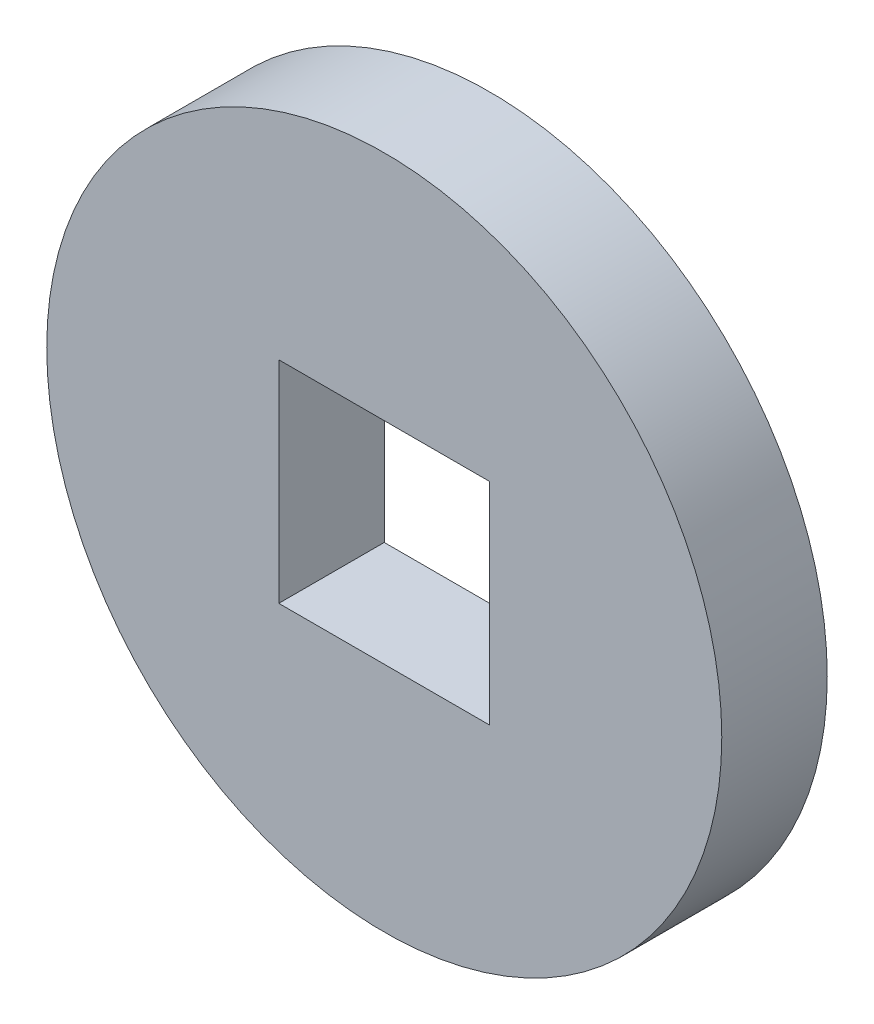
ISO-10303-21;
HEADER;
FILE_DESCRIPTION(('STEP AP214'),'2;1');
FILE_NAME('part.step','',(''),(''),'','','');
FILE_SCHEMA(('AUTOMOTIVE_DESIGN { 1 0 10303 214 1 1 1 1 }'));
ENDSEC;
DATA;
#1=APPLICATION_CONTEXT('core data for automotive mechanical design processes');
#2=APPLICATION_PROTOCOL_DEFINITION('international standard','automotive_design',2000,#1);
#3=PRODUCT_CONTEXT('',#1,'mechanical');
#4=PRODUCT('Part','Part','',(#3));
#5=PRODUCT_RELATED_PRODUCT_CATEGORY('part','',(#4));
#6=PRODUCT_DEFINITION_FORMATION('','',#4);
#7=PRODUCT_DEFINITION_CONTEXT('part definition',#1,'design');
#8=PRODUCT_DEFINITION('design','',#6,#7);
#9=PRODUCT_DEFINITION_SHAPE('','',#8);
#10=(LENGTH_UNIT() NAMED_UNIT(*) SI_UNIT(.MILLI.,.METRE.));
#11=(NAMED_UNIT(*) PLANE_ANGLE_UNIT() SI_UNIT($,.RADIAN.));
#12=(NAMED_UNIT(*) SI_UNIT($,.STERADIAN.) SOLID_ANGLE_UNIT());
#13=UNCERTAINTY_MEASURE_WITH_UNIT(LENGTH_MEASURE(1.E-05),#10,'distance_accuracy_value','');
#14=(GEOMETRIC_REPRESENTATION_CONTEXT(3) GLOBAL_UNCERTAINTY_ASSIGNED_CONTEXT((#13)) GLOBAL_UNIT_ASSIGNED_CONTEXT((#10,
#11,#12)) REPRESENTATION_CONTEXT('',''));
#15=CARTESIAN_POINT('',(0.,0.,0.));
#16=DIRECTION('',(0.,0.,1.));
#17=DIRECTION('',(1.,0.,0.));
#18=AXIS2_PLACEMENT_3D('',#15,#16,#17);
#19=CARTESIAN_POINT('',(0.,0.,3.175));
#20=DIRECTION('',(0.,0.,1.));
#21=DIRECTION('',(1.,0.,0.));
#22=AXIS2_PLACEMENT_3D('',#19,#20,#21);
#23=PLANE('',#22);
#24=CARTESIAN_POINT('',(0.,0.,3.175));
#25=DIRECTION('',(0.,0.,1.));
#26=DIRECTION('',(1.,0.,0.));
#27=AXIS2_PLACEMENT_3D('',#24,#25,#26);
#28=CIRCLE('',#27,10.16);
#29=CARTESIAN_POINT('',(10.16,0.,3.175));
#30=VERTEX_POINT('',#29);
#31=EDGE_CURVE('E11',#30,#30,#28,.T.);
#32=ORIENTED_EDGE('',*,*,#31,.T.);
#33=EDGE_LOOP('',(#32));
#34=FACE_BOUND('',#33,.T.);
#35=DIRECTION('',(-1.,0.,0.));
#36=VECTOR('',#35,1.);
#37=CARTESIAN_POINT('',(-3.175,3.175,3.175));
#38=LINE('',#37,#36);
#39=CARTESIAN_POINT('',(3.175,3.175,3.175));
#40=VERTEX_POINT('',#39);
#41=CARTESIAN_POINT('',(-3.175,3.175,3.175));
#42=VERTEX_POINT('',#41);
#43=EDGE_CURVE('E82',#40,#42,#38,.T.);
#44=ORIENTED_EDGE('',*,*,#43,.F.);
#45=DIRECTION('',(0.,1.,0.));
#46=VECTOR('',#45,1.);
#47=CARTESIAN_POINT('',(3.175,3.175,3.175));
#48=LINE('',#47,#46);
#49=CARTESIAN_POINT('',(3.175,-3.175,3.175));
#50=VERTEX_POINT('',#49);
#51=EDGE_CURVE('E74',#50,#40,#48,.T.);
#52=ORIENTED_EDGE('',*,*,#51,.F.);
#53=DIRECTION('',(1.,0.,0.));
#54=VECTOR('',#53,1.);
#55=CARTESIAN_POINT('',(-3.175,-3.175,3.175));
#56=LINE('',#55,#54);
#57=CARTESIAN_POINT('',(-3.175,-3.175,3.175));
#58=VERTEX_POINT('',#57);
#59=EDGE_CURVE('E95',#58,#50,#56,.T.);
#60=ORIENTED_EDGE('',*,*,#59,.F.);
#61=DIRECTION('',(0.,-1.,0.));
#62=VECTOR('',#61,1.);
#63=CARTESIAN_POINT('',(-3.175,3.175,3.175));
#64=LINE('',#63,#62);
#65=EDGE_CURVE('E93',#42,#58,#64,.T.);
#66=ORIENTED_EDGE('',*,*,#65,.F.);
#67=EDGE_LOOP('',(#44,#52,#60,#66));
#68=FACE_BOUND('',#67,.T.);
#69=ADVANCED_FACE('F33',(#34,#68),#23,.T.);
#70=CARTESIAN_POINT('',(0.,0.,0.));
#71=DIRECTION('',(0.,0.,1.));
#72=DIRECTION('',(1.,0.,0.));
#73=AXIS2_PLACEMENT_3D('',#70,#71,#72);
#74=PLANE('',#73);
#75=CARTESIAN_POINT('',(0.,0.,0.));
#76=DIRECTION('',(0.,0.,1.));
#77=DIRECTION('',(1.,0.,0.));
#78=AXIS2_PLACEMENT_3D('',#75,#76,#77);
#79=CIRCLE('',#78,10.16);
#80=CARTESIAN_POINT('',(10.16,0.,0.));
#81=VERTEX_POINT('',#80);
#82=EDGE_CURVE('E37',#81,#81,#79,.T.);
#83=ORIENTED_EDGE('',*,*,#82,.F.);
#84=EDGE_LOOP('',(#83));
#85=FACE_BOUND('',#84,.T.);
#86=DIRECTION('',(0.,1.,0.));
#87=VECTOR('',#86,1.);
#88=CARTESIAN_POINT('',(3.175,3.175,0.));
#89=LINE('',#88,#87);
#90=CARTESIAN_POINT('',(3.175,-3.175,0.));
#91=VERTEX_POINT('',#90);
#92=CARTESIAN_POINT('',(3.175,3.175,0.));
#93=VERTEX_POINT('',#92);
#94=EDGE_CURVE('E56',#91,#93,#89,.T.);
#95=ORIENTED_EDGE('',*,*,#94,.T.);
#96=DIRECTION('',(-1.,0.,0.));
#97=VECTOR('',#96,1.);
#98=CARTESIAN_POINT('',(-3.175,3.175,0.));
#99=LINE('',#98,#97);
#100=CARTESIAN_POINT('',(-3.175,3.175,0.));
#101=VERTEX_POINT('',#100);
#102=EDGE_CURVE('E89',#93,#101,#99,.T.);
#103=ORIENTED_EDGE('',*,*,#102,.T.);
#104=DIRECTION('',(0.,-1.,0.));
#105=VECTOR('',#104,1.);
#106=CARTESIAN_POINT('',(-3.175,3.175,0.));
#107=LINE('',#106,#105);
#108=CARTESIAN_POINT('',(-3.175,-3.175,0.));
#109=VERTEX_POINT('',#108);
#110=EDGE_CURVE('E101',#101,#109,#107,.T.);
#111=ORIENTED_EDGE('',*,*,#110,.T.);
#112=DIRECTION('',(1.,0.,0.));
#113=VECTOR('',#112,1.);
#114=CARTESIAN_POINT('',(-3.175,-3.175,0.));
#115=LINE('',#114,#113);
#116=EDGE_CURVE('E83',#109,#91,#115,.T.);
#117=ORIENTED_EDGE('',*,*,#116,.T.);
#118=EDGE_LOOP('',(#95,#103,#111,#117));
#119=FACE_BOUND('',#118,.T.);
#120=ADVANCED_FACE('F112',(#85,#119),#74,.F.);
#121=CARTESIAN_POINT('',(0.,0.,3.175));
#122=DIRECTION('',(0.,0.,-1.));
#123=DIRECTION('',(-1.,0.,0.));
#124=AXIS2_PLACEMENT_3D('',#121,#122,#123);
#125=CYLINDRICAL_SURFACE('',#124,10.16);
#126=ORIENTED_EDGE('',*,*,#31,.F.);
#127=EDGE_LOOP('',(#126));
#128=FACE_BOUND('',#127,.T.);
#129=ORIENTED_EDGE('',*,*,#82,.T.);
#130=EDGE_LOOP('',(#129));
#131=FACE_BOUND('',#130,.T.);
#132=ADVANCED_FACE('F35',(#128,#131),#125,.T.);
#133=CARTESIAN_POINT('',(3.175,3.175,3.175));
#134=DIRECTION('',(-1.,0.,0.));
#135=DIRECTION('',(0.,-1.,0.));
#136=AXIS2_PLACEMENT_3D('',#133,#134,#135);
#137=PLANE('',#136);
#138=ORIENTED_EDGE('',*,*,#94,.F.);
#139=DIRECTION('',(0.,0.,-1.));
#140=VECTOR('',#139,1.);
#141=CARTESIAN_POINT('',(3.175,-3.175,3.175));
#142=LINE('',#141,#140);
#143=EDGE_CURVE('E78',#50,#91,#142,.T.);
#144=ORIENTED_EDGE('',*,*,#143,.F.);
#145=ORIENTED_EDGE('',*,*,#51,.T.);
#146=DIRECTION('',(0.,0.,-1.));
#147=VECTOR('',#146,1.);
#148=CARTESIAN_POINT('',(3.175,3.175,3.175));
#149=LINE('',#148,#147);
#150=EDGE_CURVE('E77',#40,#93,#149,.T.);
#151=ORIENTED_EDGE('',*,*,#150,.T.);
#152=EDGE_LOOP('',(#138,#144,#145,#151));
#153=FACE_BOUND('',#152,.T.);
#154=ADVANCED_FACE('F76',(#153),#137,.T.);
#155=CARTESIAN_POINT('',(-3.175,3.175,3.175));
#156=DIRECTION('',(0.,-1.,0.));
#157=DIRECTION('',(0.,0.,-1.));
#158=AXIS2_PLACEMENT_3D('',#155,#156,#157);
#159=PLANE('',#158);
#160=ORIENTED_EDGE('',*,*,#102,.F.);
#161=ORIENTED_EDGE('',*,*,#150,.F.);
#162=ORIENTED_EDGE('',*,*,#43,.T.);
#163=DIRECTION('',(0.,0.,-1.));
#164=VECTOR('',#163,1.);
#165=CARTESIAN_POINT('',(-3.175,3.175,3.175));
#166=LINE('',#165,#164);
#167=EDGE_CURVE('E90',#42,#101,#166,.T.);
#168=ORIENTED_EDGE('',*,*,#167,.T.);
#169=EDGE_LOOP('',(#160,#161,#162,#168));
#170=FACE_BOUND('',#169,.T.);
#171=ADVANCED_FACE('F86',(#170),#159,.T.);
#172=CARTESIAN_POINT('',(-3.175,3.175,3.175));
#173=DIRECTION('',(1.,0.,0.));
#174=DIRECTION('',(0.,1.,0.));
#175=AXIS2_PLACEMENT_3D('',#172,#173,#174);
#176=PLANE('',#175);
#177=ORIENTED_EDGE('',*,*,#110,.F.);
#178=ORIENTED_EDGE('',*,*,#167,.F.);
#179=ORIENTED_EDGE('',*,*,#65,.T.);
#180=DIRECTION('',(0.,0.,-1.));
#181=VECTOR('',#180,1.);
#182=CARTESIAN_POINT('',(-3.175,-3.175,3.175));
#183=LINE('',#182,#181);
#184=EDGE_CURVE('E48',#58,#109,#183,.T.);
#185=ORIENTED_EDGE('',*,*,#184,.T.);
#186=EDGE_LOOP('',(#177,#178,#179,#185));
#187=FACE_BOUND('',#186,.T.);
#188=ADVANCED_FACE('F110',(#187),#176,.T.);
#189=CARTESIAN_POINT('',(-3.175,-3.175,3.175));
#190=DIRECTION('',(0.,1.,0.));
#191=DIRECTION('',(0.,0.,1.));
#192=AXIS2_PLACEMENT_3D('',#189,#190,#191);
#193=PLANE('',#192);
#194=ORIENTED_EDGE('',*,*,#116,.F.);
#195=ORIENTED_EDGE('',*,*,#184,.F.);
#196=ORIENTED_EDGE('',*,*,#59,.T.);
#197=ORIENTED_EDGE('',*,*,#143,.T.);
#198=EDGE_LOOP('',(#194,#195,#196,#197));
#199=FACE_BOUND('',#198,.T.);
#200=ADVANCED_FACE('F113',(#199),#193,.T.);
#201=CLOSED_SHELL('',(#69,#120,#132,#154,#171,#188,#200));
#202=MANIFOLD_SOLID_BREP('B2',#201);
#203=ADVANCED_BREP_SHAPE_REPRESENTATION('',(#18,#202),#14);
#204=SHAPE_DEFINITION_REPRESENTATION(#9,#203);
ENDSEC;
END-ISO-10303-21;
